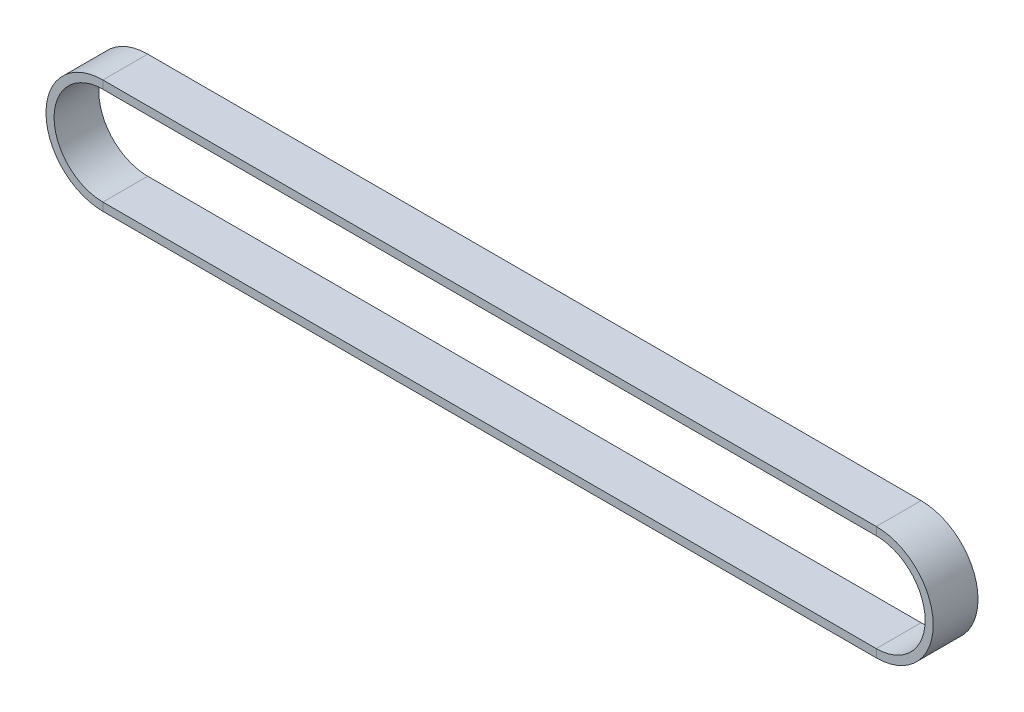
ISO-10303-21;
HEADER;
FILE_DESCRIPTION(('STEP AP214'),'2;1');
FILE_NAME('part.step','',(''),(''),'','','');
FILE_SCHEMA(('AUTOMOTIVE_DESIGN { 1 0 10303 214 1 1 1 1 }'));
ENDSEC;
DATA;
#1=APPLICATION_CONTEXT('core data for automotive mechanical design processes');
#2=APPLICATION_PROTOCOL_DEFINITION('international standard','automotive_design',2000,#1);
#3=PRODUCT_CONTEXT('',#1,'mechanical');
#4=PRODUCT('Part','Part','',(#3));
#5=PRODUCT_RELATED_PRODUCT_CATEGORY('part','',(#4));
#6=PRODUCT_DEFINITION_FORMATION('','',#4);
#7=PRODUCT_DEFINITION_CONTEXT('part definition',#1,'design');
#8=PRODUCT_DEFINITION('design','',#6,#7);
#9=PRODUCT_DEFINITION_SHAPE('','',#8);
#10=(LENGTH_UNIT() NAMED_UNIT(*) SI_UNIT(.MILLI.,.METRE.));
#11=(NAMED_UNIT(*) PLANE_ANGLE_UNIT() SI_UNIT($,.RADIAN.));
#12=(NAMED_UNIT(*) SI_UNIT($,.STERADIAN.) SOLID_ANGLE_UNIT());
#13=UNCERTAINTY_MEASURE_WITH_UNIT(LENGTH_MEASURE(1.E-05),#10,'distance_accuracy_value','');
#14=(GEOMETRIC_REPRESENTATION_CONTEXT(3) GLOBAL_UNCERTAINTY_ASSIGNED_CONTEXT((#13)) GLOBAL_UNIT_ASSIGNED_CONTEXT((#10,
#11,#12)) REPRESENTATION_CONTEXT('',''));
#15=CARTESIAN_POINT('',(0.,0.,0.));
#16=DIRECTION('',(0.,0.,1.));
#17=DIRECTION('',(1.,0.,0.));
#18=AXIS2_PLACEMENT_3D('',#15,#16,#17);
#19=CARTESIAN_POINT('',(-431.500000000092,31.7499999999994,12.5));
#20=DIRECTION('',(0.,1.,0.));
#21=DIRECTION('',(-1.,0.,0.));
#22=AXIS2_PLACEMENT_3D('',#19,#20,#21);
#23=PLANE('',#22);
#24=DIRECTION('',(1.,0.,0.));
#25=VECTOR('',#24,1.);
#26=CARTESIAN_POINT('',(-431.500000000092,31.7499999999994,-12.5));
#27=LINE('',#26,#25);
#28=CARTESIAN_POINT('',(-431.500000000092,31.7499999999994,-12.5));
#29=VERTEX_POINT('',#28);
#30=CARTESIAN_POINT('',(-9.19601479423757E-11,31.7499999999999,-12.5));
#31=VERTEX_POINT('',#30);
#32=EDGE_CURVE('E11',#29,#31,#27,.T.);
#33=ORIENTED_EDGE('',*,*,#32,.F.);
#34=DIRECTION('',(0.,0.,1.));
#35=VECTOR('',#34,1.);
#36=CARTESIAN_POINT('',(-431.500000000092,31.7499999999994,12.5));
#37=LINE('',#36,#35);
#38=CARTESIAN_POINT('',(-431.500000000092,31.7499999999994,12.5));
#39=VERTEX_POINT('',#38);
#40=EDGE_CURVE('E44',#29,#39,#37,.T.);
#41=ORIENTED_EDGE('',*,*,#40,.T.);
#42=DIRECTION('',(1.,0.,0.));
#43=VECTOR('',#42,1.);
#44=CARTESIAN_POINT('',(-431.500000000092,31.7499999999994,12.5));
#45=LINE('',#44,#43);
#46=CARTESIAN_POINT('',(-9.19601479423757E-11,31.7499999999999,12.5));
#47=VERTEX_POINT('',#46);
#48=EDGE_CURVE('E129',#39,#47,#45,.T.);
#49=ORIENTED_EDGE('',*,*,#48,.T.);
#50=DIRECTION('',(0.,0.,1.));
#51=VECTOR('',#50,1.);
#52=CARTESIAN_POINT('',(-9.19601479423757E-11,31.7499999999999,12.5));
#53=LINE('',#52,#51);
#54=EDGE_CURVE('E132',#31,#47,#53,.T.);
#55=ORIENTED_EDGE('',*,*,#54,.F.);
#56=EDGE_LOOP('',(#33,#41,#49,#55));
#57=FACE_BOUND('',#56,.T.);
#58=ADVANCED_FACE('F41',(#57),#23,.T.);
#59=CARTESIAN_POINT('',(-431.500000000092,31.7499999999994,-12.5));
#60=DIRECTION('',(0.,0.,-1.));
#61=DIRECTION('',(-1.,0.,0.));
#62=AXIS2_PLACEMENT_3D('',#59,#60,#61);
#63=PLANE('',#62);
#64=DIRECTION('',(1.,0.,0.));
#65=VECTOR('',#64,1.);
#66=CARTESIAN_POINT('',(-431.500000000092,27.2499999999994,-12.5));
#67=LINE('',#66,#65);
#68=CARTESIAN_POINT('',(-431.500000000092,27.2499999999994,-12.5));
#69=VERTEX_POINT('',#68);
#70=CARTESIAN_POINT('',(-9.19573013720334E-11,27.2499999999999,-12.5));
#71=VERTEX_POINT('',#70);
#72=EDGE_CURVE('E49',#69,#71,#67,.T.);
#73=ORIENTED_EDGE('',*,*,#72,.F.);
#74=DIRECTION('',(0.,1.,0.));
#75=VECTOR('',#74,1.);
#76=CARTESIAN_POINT('',(-431.500000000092,31.7499999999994,-12.5));
#77=LINE('',#76,#75);
#78=EDGE_CURVE('E199',#69,#29,#77,.T.);
#79=ORIENTED_EDGE('',*,*,#78,.T.);
#80=ORIENTED_EDGE('',*,*,#32,.T.);
#81=DIRECTION('',(0.,1.,0.));
#82=VECTOR('',#81,1.);
#83=CARTESIAN_POINT('',(-9.19601479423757E-11,31.7499999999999,-12.5));
#84=LINE('',#83,#82);
#85=EDGE_CURVE('E157',#71,#31,#84,.T.);
#86=ORIENTED_EDGE('',*,*,#85,.F.);
#87=EDGE_LOOP('',(#73,#79,#80,#86));
#88=FACE_BOUND('',#87,.T.);
#89=ADVANCED_FACE('F223',(#88),#63,.T.);
#90=CARTESIAN_POINT('',(-431.500000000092,27.2499999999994,12.5));
#91=DIRECTION('',(0.,-1.,0.));
#92=DIRECTION('',(1.,0.,0.));
#93=AXIS2_PLACEMENT_3D('',#90,#91,#92);
#94=PLANE('',#93);
#95=DIRECTION('',(1.,0.,0.));
#96=VECTOR('',#95,1.);
#97=CARTESIAN_POINT('',(-431.500000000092,27.2499999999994,12.5));
#98=LINE('',#97,#96);
#99=CARTESIAN_POINT('',(-431.500000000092,27.2499999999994,12.5));
#100=VERTEX_POINT('',#99);
#101=CARTESIAN_POINT('',(-9.19573013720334E-11,27.2499999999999,12.5));
#102=VERTEX_POINT('',#101);
#103=EDGE_CURVE('E138',#100,#102,#98,.T.);
#104=ORIENTED_EDGE('',*,*,#103,.F.);
#105=DIRECTION('',(0.,0.,-1.));
#106=VECTOR('',#105,1.);
#107=CARTESIAN_POINT('',(-431.500000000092,27.2499999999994,12.5));
#108=LINE('',#107,#106);
#109=EDGE_CURVE('E183',#100,#69,#108,.T.);
#110=ORIENTED_EDGE('',*,*,#109,.T.);
#111=ORIENTED_EDGE('',*,*,#72,.T.);
#112=DIRECTION('',(0.,0.,-1.));
#113=VECTOR('',#112,1.);
#114=CARTESIAN_POINT('',(-9.19573013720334E-11,27.2499999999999,12.5));
#115=LINE('',#114,#113);
#116=EDGE_CURVE('E161',#102,#71,#115,.T.);
#117=ORIENTED_EDGE('',*,*,#116,.F.);
#118=EDGE_LOOP('',(#104,#110,#111,#117));
#119=FACE_BOUND('',#118,.T.);
#120=ADVANCED_FACE('F228',(#119),#94,.T.);
#121=CARTESIAN_POINT('',(-431.500000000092,-5.82867087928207E-13,0.));
#122=DIRECTION('',(0.,0.,-1.));
#123=DIRECTION('',(-1.,0.,0.));
#124=AXIS2_PLACEMENT_3D('',#121,#122,#123);
#125=CYLINDRICAL_SURFACE('',#124,31.75);
#126=ORIENTED_EDGE('',*,*,#40,.F.);
#127=CARTESIAN_POINT('',(-431.500000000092,-5.82867087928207E-13,-12.5));
#128=DIRECTION('',(0.,0.,-1.));
#129=DIRECTION('',(0.,-1.,0.));
#130=AXIS2_PLACEMENT_3D('',#127,#128,#129);
#131=CIRCLE('',#130,31.75);
#132=CARTESIAN_POINT('',(-431.500000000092,-31.7500000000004,-12.5));
#133=VERTEX_POINT('',#132);
#134=EDGE_CURVE('E85',#133,#29,#131,.T.);
#135=ORIENTED_EDGE('',*,*,#134,.F.);
#136=DIRECTION('',(0.,0.,1.));
#137=VECTOR('',#136,1.);
#138=CARTESIAN_POINT('',(-431.500000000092,-31.7500000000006,12.5));
#139=LINE('',#138,#137);
#140=CARTESIAN_POINT('',(-431.500000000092,-31.7500000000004,12.5));
#141=VERTEX_POINT('',#140);
#142=EDGE_CURVE('E186',#133,#141,#139,.T.);
#143=ORIENTED_EDGE('',*,*,#142,.T.);
#144=CARTESIAN_POINT('',(-431.500000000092,-5.82867087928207E-13,12.5));
#145=DIRECTION('',(0.,0.,-1.));
#146=DIRECTION('',(0.,-1.,0.));
#147=AXIS2_PLACEMENT_3D('',#144,#145,#146);
#148=CIRCLE('',#147,31.75);
#149=EDGE_CURVE('E181',#141,#39,#148,.T.);
#150=ORIENTED_EDGE('',*,*,#149,.T.);
#151=EDGE_LOOP('',(#126,#135,#143,#150));
#152=FACE_BOUND('',#151,.T.);
#153=ADVANCED_FACE('F212',(#152),#125,.T.);
#154=CARTESIAN_POINT('',(-431.500000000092,-31.7500000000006,-12.5));
#155=DIRECTION('',(0.,0.,-1.));
#156=DIRECTION('',(-1.,0.,0.));
#157=AXIS2_PLACEMENT_3D('',#154,#155,#156);
#158=PLANE('',#157);
#159=ORIENTED_EDGE('',*,*,#134,.T.);
#160=ORIENTED_EDGE('',*,*,#78,.F.);
#161=CARTESIAN_POINT('',(-431.500000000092,-5.82867087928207E-13,-12.5));
#162=DIRECTION('',(0.,0.,-1.));
#163=DIRECTION('',(0.,-1.,0.));
#164=AXIS2_PLACEMENT_3D('',#161,#162,#163);
#165=CIRCLE('',#164,27.25);
#166=CARTESIAN_POINT('',(-431.500000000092,-27.2500000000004,-12.5));
#167=VERTEX_POINT('',#166);
#168=EDGE_CURVE('E94',#167,#69,#165,.T.);
#169=ORIENTED_EDGE('',*,*,#168,.F.);
#170=DIRECTION('',(0.,-1.,0.));
#171=VECTOR('',#170,1.);
#172=CARTESIAN_POINT('',(-431.500000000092,-31.7500000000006,-12.5));
#173=LINE('',#172,#171);
#174=EDGE_CURVE('E195',#167,#133,#173,.T.);
#175=ORIENTED_EDGE('',*,*,#174,.T.);
#176=EDGE_LOOP('',(#159,#160,#169,#175));
#177=FACE_BOUND('',#176,.T.);
#178=ADVANCED_FACE('F222',(#177),#158,.T.);
#179=CARTESIAN_POINT('',(-431.500000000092,-5.82867087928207E-13,0.));
#180=DIRECTION('',(0.,0.,-1.));
#181=DIRECTION('',(-1.,0.,0.));
#182=AXIS2_PLACEMENT_3D('',#179,#180,#181);
#183=CYLINDRICAL_SURFACE('',#182,27.25);
#184=ORIENTED_EDGE('',*,*,#168,.T.);
#185=ORIENTED_EDGE('',*,*,#109,.F.);
#186=CARTESIAN_POINT('',(-431.500000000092,-5.82867087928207E-13,12.5));
#187=DIRECTION('',(0.,0.,-1.));
#188=DIRECTION('',(0.,-1.,0.));
#189=AXIS2_PLACEMENT_3D('',#186,#187,#188);
#190=CIRCLE('',#189,27.25);
#191=CARTESIAN_POINT('',(-431.500000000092,-27.2500000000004,12.5));
#192=VERTEX_POINT('',#191);
#193=EDGE_CURVE('E102',#192,#100,#190,.T.);
#194=ORIENTED_EDGE('',*,*,#193,.F.);
#195=DIRECTION('',(0.,0.,-1.));
#196=VECTOR('',#195,1.);
#197=CARTESIAN_POINT('',(-431.500000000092,-27.2500000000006,12.5));
#198=LINE('',#197,#196);
#199=EDGE_CURVE('E175',#192,#167,#198,.T.);
#200=ORIENTED_EDGE('',*,*,#199,.T.);
#201=EDGE_LOOP('',(#184,#185,#194,#200));
#202=FACE_BOUND('',#201,.T.);
#203=ADVANCED_FACE('F229',(#202),#183,.F.);
#204=CARTESIAN_POINT('',(-431.500000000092,-31.7500000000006,12.5));
#205=DIRECTION('',(0.,0.,1.));
#206=DIRECTION('',(1.,0.,0.));
#207=AXIS2_PLACEMENT_3D('',#204,#205,#206);
#208=PLANE('',#207);
#209=ORIENTED_EDGE('',*,*,#193,.T.);
#210=DIRECTION('',(0.,-1.,0.));
#211=VECTOR('',#210,1.);
#212=CARTESIAN_POINT('',(-431.500000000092,31.7499999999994,12.5));
#213=LINE('',#212,#211);
#214=EDGE_CURVE('E179',#39,#100,#213,.T.);
#215=ORIENTED_EDGE('',*,*,#214,.F.);
#216=ORIENTED_EDGE('',*,*,#149,.F.);
#217=DIRECTION('',(0.,1.,0.));
#218=VECTOR('',#217,1.);
#219=CARTESIAN_POINT('',(-431.500000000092,-31.7500000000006,12.5));
#220=LINE('',#219,#218);
#221=EDGE_CURVE('E170',#141,#192,#220,.T.);
#222=ORIENTED_EDGE('',*,*,#221,.T.);
#223=EDGE_LOOP('',(#209,#215,#216,#222));
#224=FACE_BOUND('',#223,.T.);
#225=ADVANCED_FACE('F230',(#224),#208,.T.);
#226=CARTESIAN_POINT('',(9.19576728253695E-11,-31.7499999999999,12.5));
#227=DIRECTION('',(0.,-1.,0.));
#228=DIRECTION('',(1.,0.,0.));
#229=AXIS2_PLACEMENT_3D('',#226,#227,#228);
#230=PLANE('',#229);
#231=ORIENTED_EDGE('',*,*,#142,.F.);
#232=DIRECTION('',(-1.,0.,0.));
#233=VECTOR('',#232,1.);
#234=CARTESIAN_POINT('',(9.19576728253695E-11,-31.7499999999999,-12.5));
#235=LINE('',#234,#233);
#236=CARTESIAN_POINT('',(9.19588181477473E-11,-31.7500000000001,-12.5));
#237=VERTEX_POINT('',#236);
#238=EDGE_CURVE('E205',#237,#133,#235,.T.);
#239=ORIENTED_EDGE('',*,*,#238,.F.);
#240=DIRECTION('',(0.,0.,1.));
#241=VECTOR('',#240,1.);
#242=CARTESIAN_POINT('',(9.19569862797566E-11,-31.7499999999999,12.5));
#243=LINE('',#242,#241);
#244=CARTESIAN_POINT('',(9.19588181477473E-11,-31.7500000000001,12.5));
#245=VERTEX_POINT('',#244);
#246=EDGE_CURVE('E178',#237,#245,#243,.T.);
#247=ORIENTED_EDGE('',*,*,#246,.T.);
#248=DIRECTION('',(-1.,0.,0.));
#249=VECTOR('',#248,1.);
#250=CARTESIAN_POINT('',(9.19576728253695E-11,-31.7499999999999,12.5));
#251=LINE('',#250,#249);
#252=EDGE_CURVE('E173',#245,#141,#251,.T.);
#253=ORIENTED_EDGE('',*,*,#252,.T.);
#254=EDGE_LOOP('',(#231,#239,#247,#253));
#255=FACE_BOUND('',#254,.T.);
#256=ADVANCED_FACE('F217',(#255),#230,.T.);
#257=CARTESIAN_POINT('',(9.19576728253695E-11,-31.7499999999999,-12.5));
#258=DIRECTION('',(0.,0.,-1.));
#259=DIRECTION('',(-1.,0.,0.));
#260=AXIS2_PLACEMENT_3D('',#257,#258,#259);
#261=PLANE('',#260);
#262=ORIENTED_EDGE('',*,*,#238,.T.);
#263=ORIENTED_EDGE('',*,*,#174,.F.);
#264=DIRECTION('',(-1.,0.,0.));
#265=VECTOR('',#264,1.);
#266=CARTESIAN_POINT('',(9.19551770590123E-11,-27.2499999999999,-12.5));
#267=LINE('',#266,#265);
#268=CARTESIAN_POINT('',(9.19526449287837E-11,-27.2500000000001,-12.5));
#269=VERTEX_POINT('',#268);
#270=EDGE_CURVE('E114',#269,#167,#267,.T.);
#271=ORIENTED_EDGE('',*,*,#270,.F.);
#272=DIRECTION('',(0.,-1.,0.));
#273=VECTOR('',#272,1.);
#274=CARTESIAN_POINT('',(9.19569862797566E-11,-31.7499999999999,-12.5));
#275=LINE('',#274,#273);
#276=EDGE_CURVE('E192',#269,#237,#275,.T.);
#277=ORIENTED_EDGE('',*,*,#276,.T.);
#278=EDGE_LOOP('',(#262,#263,#271,#277));
#279=FACE_BOUND('',#278,.T.);
#280=ADVANCED_FACE('F221',(#279),#261,.T.);
#281=CARTESIAN_POINT('',(9.19551770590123E-11,-27.2499999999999,12.5));
#282=DIRECTION('',(0.,1.,0.));
#283=DIRECTION('',(-1.,0.,0.));
#284=AXIS2_PLACEMENT_3D('',#281,#282,#283);
#285=PLANE('',#284);
#286=ORIENTED_EDGE('',*,*,#270,.T.);
#287=ORIENTED_EDGE('',*,*,#199,.F.);
#288=DIRECTION('',(-1.,0.,0.));
#289=VECTOR('',#288,1.);
#290=CARTESIAN_POINT('',(9.19551770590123E-11,-27.2499999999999,12.5));
#291=LINE('',#290,#289);
#292=CARTESIAN_POINT('',(9.19526449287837E-11,-27.2500000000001,12.5));
#293=VERTEX_POINT('',#292);
#294=EDGE_CURVE('E120',#293,#192,#291,.T.);
#295=ORIENTED_EDGE('',*,*,#294,.F.);
#296=DIRECTION('',(0.,0.,-1.));
#297=VECTOR('',#296,1.);
#298=CARTESIAN_POINT('',(9.19545878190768E-11,-27.2499999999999,12.5));
#299=LINE('',#298,#297);
#300=EDGE_CURVE('E168',#293,#269,#299,.T.);
#301=ORIENTED_EDGE('',*,*,#300,.T.);
#302=EDGE_LOOP('',(#286,#287,#295,#301));
#303=FACE_BOUND('',#302,.T.);
#304=ADVANCED_FACE('F285',(#303),#285,.T.);
#305=CARTESIAN_POINT('',(9.19576728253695E-11,-31.7499999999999,12.5));
#306=DIRECTION('',(0.,0.,1.));
#307=DIRECTION('',(1.,0.,0.));
#308=AXIS2_PLACEMENT_3D('',#305,#306,#307);
#309=PLANE('',#308);
#310=ORIENTED_EDGE('',*,*,#294,.T.);
#311=ORIENTED_EDGE('',*,*,#221,.F.);
#312=ORIENTED_EDGE('',*,*,#252,.F.);
#313=DIRECTION('',(0.,1.,0.));
#314=VECTOR('',#313,1.);
#315=CARTESIAN_POINT('',(9.19569862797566E-11,-31.7499999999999,12.5));
#316=LINE('',#315,#314);
#317=EDGE_CURVE('E149',#245,#293,#316,.T.);
#318=ORIENTED_EDGE('',*,*,#317,.T.);
#319=EDGE_LOOP('',(#310,#311,#312,#318));
#320=FACE_BOUND('',#319,.T.);
#321=ADVANCED_FACE('F215',(#320),#309,.T.);
#322=CARTESIAN_POINT('',(-9.1926466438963E-11,-1.11022302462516E-13,0.));
#323=DIRECTION('',(0.,0.,-1.));
#324=DIRECTION('',(-1.,0.,0.));
#325=AXIS2_PLACEMENT_3D('',#322,#323,#324);
#326=CYLINDRICAL_SURFACE('',#325,31.75);
#327=ORIENTED_EDGE('',*,*,#246,.F.);
#328=CARTESIAN_POINT('',(-9.1926466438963E-11,-1.11022302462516E-13,-12.5));
#329=DIRECTION('',(0.,0.,-1.));
#330=DIRECTION('',(0.,1.,0.));
#331=AXIS2_PLACEMENT_3D('',#328,#329,#330);
#332=CIRCLE('',#331,31.75);
#333=EDGE_CURVE('E156',#31,#237,#332,.T.);
#334=ORIENTED_EDGE('',*,*,#333,.F.);
#335=ORIENTED_EDGE('',*,*,#54,.T.);
#336=CARTESIAN_POINT('',(-9.1926466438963E-11,-1.11022302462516E-13,12.5));
#337=DIRECTION('',(0.,0.,-1.));
#338=DIRECTION('',(0.,1.,0.));
#339=AXIS2_PLACEMENT_3D('',#336,#337,#338);
#340=CIRCLE('',#339,31.75);
#341=EDGE_CURVE('E144',#47,#245,#340,.T.);
#342=ORIENTED_EDGE('',*,*,#341,.T.);
#343=EDGE_LOOP('',(#327,#334,#335,#342));
#344=FACE_BOUND('',#343,.T.);
#345=ADVANCED_FACE('F154',(#344),#326,.T.);
#346=CARTESIAN_POINT('',(-9.19601479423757E-11,31.7499999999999,-12.5));
#347=DIRECTION('',(0.,0.,-1.));
#348=DIRECTION('',(-1.,0.,0.));
#349=AXIS2_PLACEMENT_3D('',#346,#347,#348);
#350=PLANE('',#349);
#351=ORIENTED_EDGE('',*,*,#333,.T.);
#352=ORIENTED_EDGE('',*,*,#276,.F.);
#353=CARTESIAN_POINT('',(-9.1926466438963E-11,-1.11022302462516E-13,-12.5));
#354=DIRECTION('',(0.,0.,-1.));
#355=DIRECTION('',(0.,1.,0.));
#356=AXIS2_PLACEMENT_3D('',#353,#354,#355);
#357=CIRCLE('',#356,27.25);
#358=EDGE_CURVE('E189',#71,#269,#357,.T.);
#359=ORIENTED_EDGE('',*,*,#358,.F.);
#360=ORIENTED_EDGE('',*,*,#85,.T.);
#361=EDGE_LOOP('',(#351,#352,#359,#360));
#362=FACE_BOUND('',#361,.T.);
#363=ADVANCED_FACE('F219',(#362),#350,.T.);
#364=CARTESIAN_POINT('',(-9.1926466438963E-11,-1.11022302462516E-13,0.));
#365=DIRECTION('',(0.,0.,-1.));
#366=DIRECTION('',(-1.,0.,0.));
#367=AXIS2_PLACEMENT_3D('',#364,#365,#366);
#368=CYLINDRICAL_SURFACE('',#367,27.25);
#369=ORIENTED_EDGE('',*,*,#358,.T.);
#370=ORIENTED_EDGE('',*,*,#300,.F.);
#371=CARTESIAN_POINT('',(-9.1926466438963E-11,-1.11022302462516E-13,12.5));
#372=DIRECTION('',(0.,0.,-1.));
#373=DIRECTION('',(0.,1.,0.));
#374=AXIS2_PLACEMENT_3D('',#371,#372,#373);
#375=CIRCLE('',#374,27.25);
#376=EDGE_CURVE('E167',#102,#293,#375,.T.);
#377=ORIENTED_EDGE('',*,*,#376,.F.);
#378=ORIENTED_EDGE('',*,*,#116,.T.);
#379=EDGE_LOOP('',(#369,#370,#377,#378));
#380=FACE_BOUND('',#379,.T.);
#381=ADVANCED_FACE('F226',(#380),#368,.F.);
#382=CARTESIAN_POINT('',(-9.19601479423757E-11,31.7499999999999,12.5));
#383=DIRECTION('',(0.,0.,1.));
#384=DIRECTION('',(1.,0.,0.));
#385=AXIS2_PLACEMENT_3D('',#382,#383,#384);
#386=PLANE('',#385);
#387=ORIENTED_EDGE('',*,*,#376,.T.);
#388=ORIENTED_EDGE('',*,*,#317,.F.);
#389=ORIENTED_EDGE('',*,*,#341,.F.);
#390=DIRECTION('',(0.,-1.,0.));
#391=VECTOR('',#390,1.);
#392=CARTESIAN_POINT('',(-9.19601479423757E-11,31.7499999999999,12.5));
#393=LINE('',#392,#391);
#394=EDGE_CURVE('E147',#47,#102,#393,.T.);
#395=ORIENTED_EDGE('',*,*,#394,.T.);
#396=EDGE_LOOP('',(#387,#388,#389,#395));
#397=FACE_BOUND('',#396,.T.);
#398=ADVANCED_FACE('F146',(#397),#386,.T.);
#399=CARTESIAN_POINT('',(-431.500000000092,31.7499999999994,12.5));
#400=DIRECTION('',(0.,0.,1.));
#401=DIRECTION('',(1.,0.,0.));
#402=AXIS2_PLACEMENT_3D('',#399,#400,#401);
#403=PLANE('',#402);
#404=ORIENTED_EDGE('',*,*,#214,.T.);
#405=ORIENTED_EDGE('',*,*,#103,.T.);
#406=ORIENTED_EDGE('',*,*,#394,.F.);
#407=ORIENTED_EDGE('',*,*,#48,.F.);
#408=EDGE_LOOP('',(#404,#405,#406,#407));
#409=FACE_BOUND('',#408,.T.);
#410=ADVANCED_FACE('F159',(#409),#403,.T.);
#411=CLOSED_SHELL('',(#58,#89,#120,#153,#178,#203,#225,#256,#280,#304,#321,#345,#363,#381,#398,#410));
#412=MANIFOLD_SOLID_BREP('B2',#411);
#413=ADVANCED_BREP_SHAPE_REPRESENTATION('',(#18,#412),#14);
#414=SHAPE_DEFINITION_REPRESENTATION(#9,#413);
ENDSEC;
END-ISO-10303-21;
